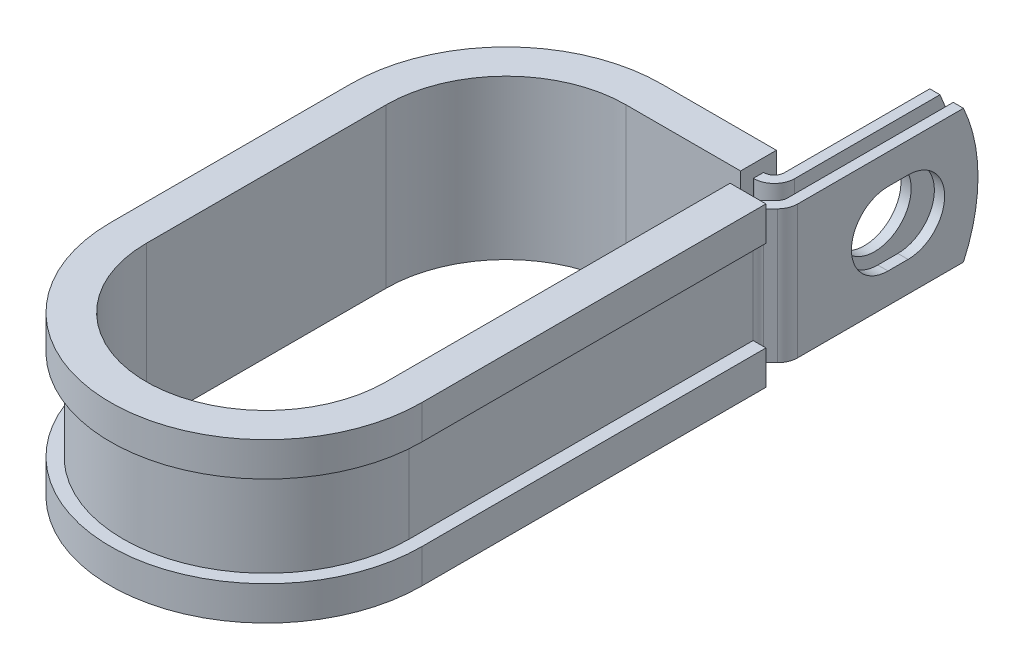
from build123d import *

# Parameters (mm, degrees)
EXTRUDE_THIN1_DEPTH = 7.9375
SKETCH2_R           = 4.3561
CUT_EXTRUDE1_DEPTH  = 1.2192
CUT_EXTRUDE2_DEPTH  = 1.2192
CUT_EXTRUDE3_DEPTH  = 57.244196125


with BuildPart() as part:
    # Sketch1 → Extrude-Thin1 (new, symmetric)
    with BuildSketch(Plane(origin=(0, 0, 0), x_dir=(1, 0, 0), z_dir=(0, 1, 0))):
        with BuildLine():
            Line((17.7089698, 37.2872), (17.7089698, 15.8115))
            ThreePointArc((17.7089698, 15.8115), (17.616163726, 15.344932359), (17.351874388, 14.949395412))
            Line((17.351874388, 14.949395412), (16.525690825, 14.123211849))
            ThreePointArc((16.525690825, 14.123211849), (15.997112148, 13.332137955), (15.8115, 12.399002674))
            Line((15.8115, 12.399002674), (15.8115, 0))
            Line((15.8115, 0), (15.8115, -28.575))
            ThreePointArc((15.8115, -28.575), (0, -44.3865), (-15.8115, -28.575))
            Line((-15.8115, -28.575), (-15.8115, 0))
            ThreePointArc((-15.8115, 0), (-11.180418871, 11.180418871), (0, 15.8115))
            Line((0, 15.8115), (13.6957698, 15.8115))
            ThreePointArc((13.6957698, 15.8115), (15.419978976, 16.525690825), (16.1341698, 18.2499))
            Line((16.1341698, 18.2499), (16.1341698, 37.2872))
            Line((16.1341698, 37.2872), (14.9149698, 37.2872))
            Line((14.9149698, 37.2872), (14.9149698, 18.2499))
            ThreePointArc((14.9149698, 18.2499), (14.557874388, 17.387795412), (13.6957698, 17.0307))
            Line((13.6957698, 17.0307), (0, 17.0307))
            ThreePointArc((0, 17.0307), (-12.042523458, 12.042523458), (-17.0307, 0))
            Line((-17.0307, 0), (-17.0307, -28.575))
            ThreePointArc((-17.0307, -28.575), (0, -45.6057), (17.0307, -28.575))
            Line((17.0307, -28.575), (17.0307, 0))
            Line((17.0307, 0), (17.0307, 12.399002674))
            ThreePointArc((17.0307, 12.399002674), (17.123506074, 12.865570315), (17.387795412, 13.261107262))
            Line((17.387795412, 13.261107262), (18.213978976, 14.087290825))
            ThreePointArc((18.213978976, 14.087290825), (18.742557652, 14.878364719), (18.9281698, 15.8115))
            Line((18.9281698, 15.8115), (18.9281698, 37.2872))
            Line((18.9281698, 37.2872), (17.7089698, 37.2872))
        make_face()
    extrude(amount=EXTRUDE_THIN1_DEPTH, both=True)

    # Sketch2 → Cut-Extrude1 (cut)
    with BuildSketch(Plane.ZY.offset(-14.9149698)):
        with Locations((-27.7622, 0)):
            Circle(SKETCH2_R)
    extrude(amount=-CUT_EXTRUDE1_DEPTH, mode=Mode.SUBTRACT)

    # Sketch3 → Cut-Extrude2 (cut)
    with BuildSketch(Plane(origin=(18.9281698, 0, 0), x_dir=(0, 0, -1), z_dir=(1, 0, 0))):
        with BuildLine():
            Line((26.5684, 4.3561), (28.956, 4.3561))
            ThreePointArc((28.956, 4.3561), (33.3121, 0), (28.956, -4.3561))
            Line((28.956, -4.3561), (26.5684, -4.3561))
            ThreePointArc((26.5684, -4.3561), (22.2123, 0), (26.5684, 4.3561))
        make_face()
    extrude(amount=-CUT_EXTRUDE2_DEPTH, mode=Mode.SUBTRACT)

    # Sketch4 → Cut-Extrude3 (cut, through all)
    with BuildSketch(Plane.ZY.offset(-14.9149698)):
        with BuildLine():
            Line((-35.554780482, 7.9375), (-37.2872, 7.9375))
            Line((-37.2872, 7.9375), (-37.2872, 0))
            ThreePointArc((-37.2872, 0), (-36.849056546, 4.062178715), (-35.554780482, 7.9375))
        make_face()
        with BuildLine():
            ThreePointArc((-35.554780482, -7.9375), (-36.849056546, -4.062178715), (-37.2872, 0))
            Line((-37.2872, 0), (-37.2872, -7.9375))
            Line((-37.2872, -7.9375), (-35.554780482, -7.9375))
        make_face()
    extrude(amount=-CUT_EXTRUDE3_DEPTH, mode=Mode.SUBTRACT)

    # Sweep1: sweep along a path in Sketch6
    with BuildLine(Plane(origin=(0, 7.9375, 0), x_dir=(1, 0, 0), z_dir=(0, 1, 0))) as sweep1_path:
        Line((14.2875, 12.399002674), (14.2875, 0))
        Line((14.2875, 0), (14.2875, -28.575))
        ThreePointArc((14.2875, -28.575), (0, -42.8625), (-14.2875, -28.575))
        Line((-14.2875, -28.575), (-14.2875, 0))
        ThreePointArc((-14.2875, 0), (-10.102788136, 10.102788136), (0, 14.2875))
        Line((0, 14.2875), (13.6449698, 14.2875))
    # Sketch5 → Sweep1 (sweep)
    with BuildSketch(Plane(origin=(0, 0, -12.399002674), x_dir=(-1, 0, 0), z_dir=(0, 0, -1))):
        Polygon((-17.0307, 7.9375), (-15.8115, 7.9375), (-15.8115, -7.9375), (-17.0307, -7.9375), (-17.0307, -5.3975), (-18.5547, -5.3975), (-18.5547, -9.4615), (-14.2875, -9.4615), (-14.2875, 9.4615), (-18.5547, 9.4615), (-18.5547, 5.3975), (-17.0307, 5.3975), align=None)
    sweep(path=sweep1_path.line)


solid = part.part
